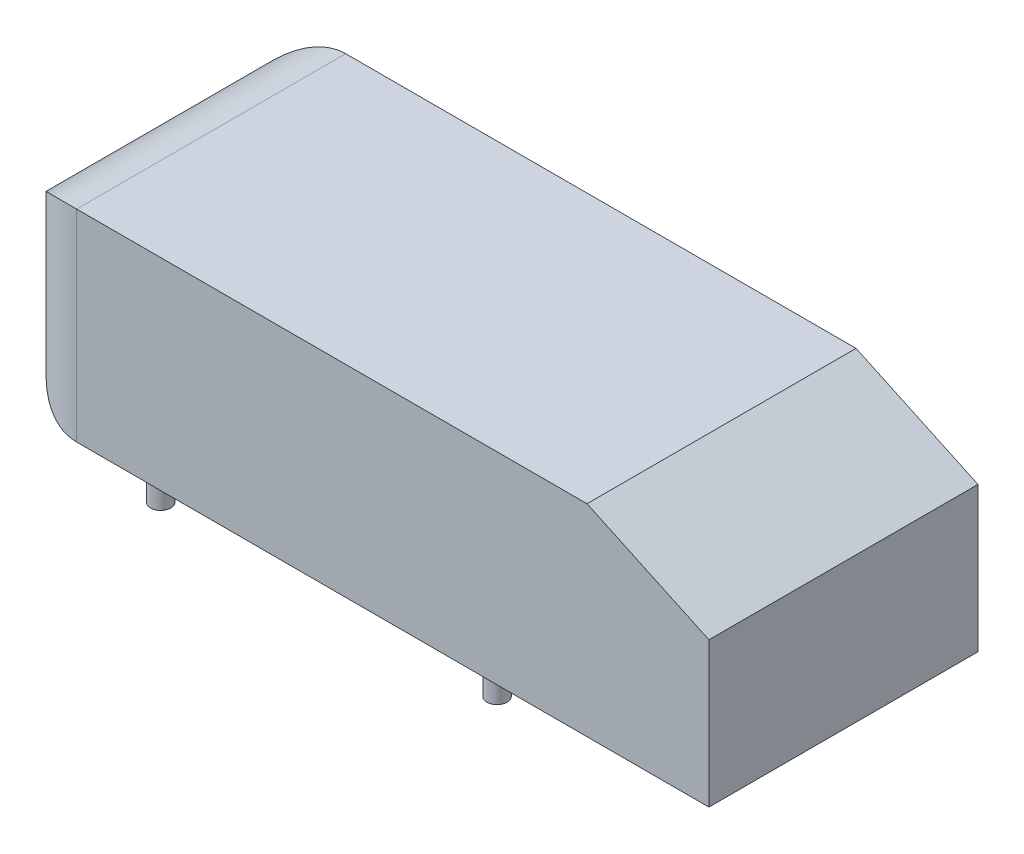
ISO-10303-21;
HEADER;
FILE_DESCRIPTION(('STEP AP214'),'2;1');
FILE_NAME('part.step','',(''),(''),'','','');
FILE_SCHEMA(('AUTOMOTIVE_DESIGN { 1 0 10303 214 1 1 1 1 }'));
ENDSEC;
DATA;
#1=APPLICATION_CONTEXT('core data for automotive mechanical design processes');
#2=APPLICATION_PROTOCOL_DEFINITION('international standard','automotive_design',2000,#1);
#3=PRODUCT_CONTEXT('',#1,'mechanical');
#4=PRODUCT('Part','Part','',(#3));
#5=PRODUCT_RELATED_PRODUCT_CATEGORY('part','',(#4));
#6=PRODUCT_DEFINITION_FORMATION('','',#4);
#7=PRODUCT_DEFINITION_CONTEXT('part definition',#1,'design');
#8=PRODUCT_DEFINITION('design','',#6,#7);
#9=PRODUCT_DEFINITION_SHAPE('','',#8);
#10=(LENGTH_UNIT() NAMED_UNIT(*) SI_UNIT(.MILLI.,.METRE.));
#11=(NAMED_UNIT(*) PLANE_ANGLE_UNIT() SI_UNIT($,.RADIAN.));
#12=(NAMED_UNIT(*) SI_UNIT($,.STERADIAN.) SOLID_ANGLE_UNIT());
#13=UNCERTAINTY_MEASURE_WITH_UNIT(LENGTH_MEASURE(1.E-05),#10,'distance_accuracy_value','');
#14=(GEOMETRIC_REPRESENTATION_CONTEXT(3) GLOBAL_UNCERTAINTY_ASSIGNED_CONTEXT((#13)) GLOBAL_UNIT_ASSIGNED_CONTEXT((#10,
#11,#12)) REPRESENTATION_CONTEXT('',''));
#15=CARTESIAN_POINT('',(0.,0.,0.));
#16=DIRECTION('',(0.,0.,1.));
#17=DIRECTION('',(1.,0.,0.));
#18=AXIS2_PLACEMENT_3D('',#15,#16,#17);
#19=CARTESIAN_POINT('',(-1050.,350.,200.));
#20=DIRECTION('',(0.,0.,1.));
#21=DIRECTION('',(0.,-1.,0.));
#22=AXIS2_PLACEMENT_3D('',#19,#20,#21);
#23=PLANE('',#22);
#24=DIRECTION('',(0.906307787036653,-0.422618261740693,0.));
#25=VECTOR('',#24,1.);
#26=CARTESIAN_POINT('',(0.,265.476347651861,200.));
#27=LINE('',#26,#25);
#28=CARTESIAN_POINT('',(-181.261557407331,350.,200.));
#29=VERTEX_POINT('',#28);
#30=CARTESIAN_POINT('',(0.,265.476347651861,200.));
#31=VERTEX_POINT('',#30);
#32=EDGE_CURVE('E64',#29,#31,#27,.T.);
#33=ORIENTED_EDGE('',*,*,#32,.F.);
#34=DIRECTION('',(1.,0.,0.));
#35=VECTOR('',#34,1.);
#36=CARTESIAN_POINT('',(-1050.,350.,200.));
#37=LINE('',#36,#35);
#38=CARTESIAN_POINT('',(-940.,350.,200.));
#39=VERTEX_POINT('',#38);
#40=EDGE_CURVE('E115',#39,#29,#37,.T.);
#41=ORIENTED_EDGE('',*,*,#40,.F.);
#42=DIRECTION('',(0.,-1.,0.));
#43=VECTOR('',#42,1.);
#44=CARTESIAN_POINT('',(-940.,50.,200.));
#45=LINE('',#44,#43);
#46=CARTESIAN_POINT('',(-940.,50.,200.));
#47=VERTEX_POINT('',#46);
#48=EDGE_CURVE('E56',#39,#47,#45,.T.);
#49=ORIENTED_EDGE('',*,*,#48,.T.);
#50=DIRECTION('',(1.,0.,0.));
#51=VECTOR('',#50,1.);
#52=CARTESIAN_POINT('',(-1050.,50.,200.));
#53=LINE('',#52,#51);
#54=CARTESIAN_POINT('',(0.,50.,200.));
#55=VERTEX_POINT('',#54);
#56=EDGE_CURVE('E135',#47,#55,#53,.T.);
#57=ORIENTED_EDGE('',*,*,#56,.T.);
#58=DIRECTION('',(0.,-1.,0.));
#59=VECTOR('',#58,1.);
#60=CARTESIAN_POINT('',(0.,350.,200.));
#61=LINE('',#60,#59);
#62=EDGE_CURVE('E118',#31,#55,#61,.T.);
#63=ORIENTED_EDGE('',*,*,#62,.F.);
#64=EDGE_LOOP('',(#33,#41,#49,#57,#63));
#65=FACE_BOUND('',#64,.T.);
#66=ADVANCED_FACE('F47',(#65),#23,.T.);
#67=CARTESIAN_POINT('',(-1050.,350.,200.));
#68=DIRECTION('',(0.,1.,0.));
#69=DIRECTION('',(0.,0.,1.));
#70=AXIS2_PLACEMENT_3D('',#67,#68,#69);
#71=PLANE('',#70);
#72=DIRECTION('',(0.,0.,1.));
#73=VECTOR('',#72,1.);
#74=CARTESIAN_POINT('',(-181.261557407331,350.,-200.));
#75=LINE('',#74,#73);
#76=CARTESIAN_POINT('',(-181.261557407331,350.,-200.));
#77=VERTEX_POINT('',#76);
#78=EDGE_CURVE('E106',#77,#29,#75,.T.);
#79=ORIENTED_EDGE('',*,*,#78,.F.);
#80=DIRECTION('',(1.,0.,0.));
#81=VECTOR('',#80,1.);
#82=CARTESIAN_POINT('',(-1050.,350.,-200.));
#83=LINE('',#82,#81);
#84=CARTESIAN_POINT('',(-940.,350.,-200.));
#85=VERTEX_POINT('',#84);
#86=EDGE_CURVE('E123',#85,#77,#83,.T.);
#87=ORIENTED_EDGE('',*,*,#86,.F.);
#88=DIRECTION('',(0.,0.,1.));
#89=VECTOR('',#88,1.);
#90=CARTESIAN_POINT('',(-940.,350.,200.));
#91=LINE('',#90,#89);
#92=EDGE_CURVE('E11',#85,#39,#91,.T.);
#93=ORIENTED_EDGE('',*,*,#92,.T.);
#94=ORIENTED_EDGE('',*,*,#40,.T.);
#95=EDGE_LOOP('',(#79,#87,#93,#94));
#96=FACE_BOUND('',#95,.T.);
#97=ADVANCED_FACE('F121',(#96),#71,.T.);
#98=CARTESIAN_POINT('',(-1050.,350.,-200.));
#99=DIRECTION('',(0.,0.,-1.));
#100=DIRECTION('',(0.,1.,0.));
#101=AXIS2_PLACEMENT_3D('',#98,#99,#100);
#102=PLANE('',#101);
#103=DIRECTION('',(0.906307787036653,-0.422618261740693,0.));
#104=VECTOR('',#103,1.);
#105=CARTESIAN_POINT('',(0.,265.476347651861,-200.));
#106=LINE('',#105,#104);
#107=CARTESIAN_POINT('',(0.,265.476347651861,-200.));
#108=VERTEX_POINT('',#107);
#109=EDGE_CURVE('E109',#77,#108,#106,.T.);
#110=ORIENTED_EDGE('',*,*,#109,.T.);
#111=DIRECTION('',(0.,1.,0.));
#112=VECTOR('',#111,1.);
#113=CARTESIAN_POINT('',(0.,350.,-200.));
#114=LINE('',#113,#112);
#115=CARTESIAN_POINT('',(0.,50.,-200.));
#116=VERTEX_POINT('',#115);
#117=EDGE_CURVE('E131',#116,#108,#114,.T.);
#118=ORIENTED_EDGE('',*,*,#117,.F.);
#119=DIRECTION('',(1.,0.,0.));
#120=VECTOR('',#119,1.);
#121=CARTESIAN_POINT('',(-1050.,50.,-200.));
#122=LINE('',#121,#120);
#123=CARTESIAN_POINT('',(-940.,50.,-200.));
#124=VERTEX_POINT('',#123);
#125=EDGE_CURVE('E128',#124,#116,#122,.T.);
#126=ORIENTED_EDGE('',*,*,#125,.F.);
#127=DIRECTION('',(0.,1.,0.));
#128=VECTOR('',#127,1.);
#129=CARTESIAN_POINT('',(-940.,350.,-200.));
#130=LINE('',#129,#128);
#131=EDGE_CURVE('E122',#124,#85,#130,.T.);
#132=ORIENTED_EDGE('',*,*,#131,.T.);
#133=ORIENTED_EDGE('',*,*,#86,.T.);
#134=EDGE_LOOP('',(#110,#118,#126,#132,#133));
#135=FACE_BOUND('',#134,.T.);
#136=ADVANCED_FACE('F198',(#135),#102,.T.);
#137=CARTESIAN_POINT('',(-1050.,50.,200.));
#138=DIRECTION('',(0.,-1.,0.));
#139=DIRECTION('',(0.,0.,-1.));
#140=AXIS2_PLACEMENT_3D('',#137,#138,#139);
#141=PLANE('',#140);
#142=CARTESIAN_POINT('',(-850.,50.,-165.));
#143=DIRECTION('',(0.,-1.,0.));
#144=DIRECTION('',(0.,0.,1.));
#145=AXIS2_PLACEMENT_3D('',#142,#143,#144);
#146=CIRCLE('',#145,15.);
#147=CARTESIAN_POINT('',(-850.,50.,-150.));
#148=VERTEX_POINT('',#147);
#149=EDGE_CURVE('E183',#148,#148,#146,.T.);
#150=ORIENTED_EDGE('',*,*,#149,.F.);
#151=EDGE_LOOP('',(#150));
#152=FACE_BOUND('',#151,.T.);
#153=CARTESIAN_POINT('',(-350.,50.,-165.));
#154=DIRECTION('',(0.,-1.,0.));
#155=DIRECTION('',(0.,0.,1.));
#156=AXIS2_PLACEMENT_3D('',#153,#154,#155);
#157=CIRCLE('',#156,15.);
#158=CARTESIAN_POINT('',(-350.,50.,-150.));
#159=VERTEX_POINT('',#158);
#160=EDGE_CURVE('E177',#159,#159,#157,.T.);
#161=ORIENTED_EDGE('',*,*,#160,.F.);
#162=EDGE_LOOP('',(#161));
#163=FACE_BOUND('',#162,.T.);
#164=CARTESIAN_POINT('',(-350.,50.,165.));
#165=DIRECTION('',(0.,-1.,0.));
#166=DIRECTION('',(0.,0.,-1.));
#167=AXIS2_PLACEMENT_3D('',#164,#165,#166);
#168=CIRCLE('',#167,15.);
#169=CARTESIAN_POINT('',(-350.,50.,150.));
#170=VERTEX_POINT('',#169);
#171=EDGE_CURVE('E171',#170,#170,#168,.T.);
#172=ORIENTED_EDGE('',*,*,#171,.F.);
#173=EDGE_LOOP('',(#172));
#174=FACE_BOUND('',#173,.T.);
#175=CARTESIAN_POINT('',(-850.,50.,165.));
#176=DIRECTION('',(0.,-1.,0.));
#177=DIRECTION('',(0.,0.,-1.));
#178=AXIS2_PLACEMENT_3D('',#175,#176,#177);
#179=CIRCLE('',#178,15.);
#180=CARTESIAN_POINT('',(-850.,50.,150.));
#181=VERTEX_POINT('',#180);
#182=EDGE_CURVE('E168',#181,#181,#179,.T.);
#183=ORIENTED_EDGE('',*,*,#182,.F.);
#184=EDGE_LOOP('',(#183));
#185=FACE_BOUND('',#184,.T.);
#186=ORIENTED_EDGE('',*,*,#56,.F.);
#187=DIRECTION('',(0.,0.,-1.));
#188=VECTOR('',#187,1.);
#189=CARTESIAN_POINT('',(-940.,50.,-200.));
#190=LINE('',#189,#188);
#191=EDGE_CURVE('E145',#47,#124,#190,.T.);
#192=ORIENTED_EDGE('',*,*,#191,.T.);
#193=ORIENTED_EDGE('',*,*,#125,.T.);
#194=DIRECTION('',(0.,0.,-1.));
#195=VECTOR('',#194,1.);
#196=CARTESIAN_POINT('',(0.,50.,200.));
#197=LINE('',#196,#195);
#198=EDGE_CURVE('E161',#55,#116,#197,.T.);
#199=ORIENTED_EDGE('',*,*,#198,.F.);
#200=EDGE_LOOP('',(#186,#192,#193,#199));
#201=FACE_BOUND('',#200,.T.);
#202=ADVANCED_FACE('F194',(#152,#163,#174,#185,#201),#141,.T.);
#203=CARTESIAN_POINT('',(-1050.,0.,0.));
#204=DIRECTION('',(1.,0.,0.));
#205=DIRECTION('',(0.,0.,-1.));
#206=AXIS2_PLACEMENT_3D('',#203,#204,#205);
#207=PLANE('',#206);
#208=DIRECTION('',(0.,0.,1.));
#209=VECTOR('',#208,1.);
#210=CARTESIAN_POINT('',(-1050.,240.,-200.));
#211=LINE('',#210,#209);
#212=CARTESIAN_POINT('',(-1050.,240.,90.0000000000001));
#213=VERTEX_POINT('',#212);
#214=CARTESIAN_POINT('',(-1050.,240.,-89.9999999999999));
#215=VERTEX_POINT('',#214);
#216=EDGE_CURVE('E126',#213,#215,#211,.F.);
#217=ORIENTED_EDGE('',*,*,#216,.T.);
#218=DIRECTION('',(0.,1.,0.));
#219=VECTOR('',#218,1.);
#220=CARTESIAN_POINT('',(-1050.,50.,-90.));
#221=LINE('',#220,#219);
#222=CARTESIAN_POINT('',(-1050.,160.,-89.9999999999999));
#223=VERTEX_POINT('',#222);
#224=EDGE_CURVE('E142',#215,#223,#221,.F.);
#225=ORIENTED_EDGE('',*,*,#224,.T.);
#226=DIRECTION('',(0.,0.,-1.));
#227=VECTOR('',#226,1.);
#228=CARTESIAN_POINT('',(-1050.,160.,200.));
#229=LINE('',#228,#227);
#230=CARTESIAN_POINT('',(-1050.,160.,90.0000000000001));
#231=VERTEX_POINT('',#230);
#232=EDGE_CURVE('E140',#223,#231,#229,.F.);
#233=ORIENTED_EDGE('',*,*,#232,.T.);
#234=DIRECTION('',(0.,-1.,0.));
#235=VECTOR('',#234,1.);
#236=CARTESIAN_POINT('',(-1050.,350.,90.0000000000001));
#237=LINE('',#236,#235);
#238=EDGE_CURVE('E138',#231,#213,#237,.F.);
#239=ORIENTED_EDGE('',*,*,#238,.T.);
#240=EDGE_LOOP('',(#217,#225,#233,#239));
#241=FACE_BOUND('',#240,.T.);
#242=ADVANCED_FACE('F197',(#241),#207,.F.);
#243=CARTESIAN_POINT('',(0.,0.,0.));
#244=DIRECTION('',(1.,0.,0.));
#245=DIRECTION('',(0.,0.,-1.));
#246=AXIS2_PLACEMENT_3D('',#243,#244,#245);
#247=PLANE('',#246);
#248=DIRECTION('',(0.,0.,1.));
#249=VECTOR('',#248,1.);
#250=CARTESIAN_POINT('',(0.,265.476347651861,-200.));
#251=LINE('',#250,#249);
#252=EDGE_CURVE('E111',#108,#31,#251,.T.);
#253=ORIENTED_EDGE('',*,*,#252,.T.);
#254=ORIENTED_EDGE('',*,*,#62,.T.);
#255=ORIENTED_EDGE('',*,*,#198,.T.);
#256=ORIENTED_EDGE('',*,*,#117,.T.);
#257=EDGE_LOOP('',(#253,#254,#255,#256));
#258=FACE_BOUND('',#257,.T.);
#259=ADVANCED_FACE('F221',(#258),#247,.T.);
#260=CARTESIAN_POINT('',(-940.,350.,90.0000000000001));
#261=DIRECTION('',(0.,1.,0.));
#262=DIRECTION('',(0.,0.,1.));
#263=AXIS2_PLACEMENT_3D('',#260,#261,#262);
#264=CYLINDRICAL_SURFACE('',#263,110.);
#265=CARTESIAN_POINT('',(-940.,240.,90.0000000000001));
#266=DIRECTION('',(0.,0.707106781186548,-0.707106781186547));
#267=DIRECTION('',(0.,-0.707106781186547,-0.707106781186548));
#268=AXIS2_PLACEMENT_3D('',#265,#266,#267);
#269=ELLIPSE('',#268,155.56349186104,110.);
#270=EDGE_CURVE('E151',#213,#39,#269,.T.);
#271=ORIENTED_EDGE('',*,*,#270,.F.);
#272=ORIENTED_EDGE('',*,*,#238,.F.);
#273=CARTESIAN_POINT('',(-940.,160.,90.0000000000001));
#274=DIRECTION('',(0.,0.707106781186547,0.707106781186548));
#275=DIRECTION('',(0.,0.707106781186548,-0.707106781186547));
#276=AXIS2_PLACEMENT_3D('',#273,#274,#275);
#277=ELLIPSE('',#276,155.56349186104,110.);
#278=EDGE_CURVE('E51',#47,#231,#277,.F.);
#279=ORIENTED_EDGE('',*,*,#278,.F.);
#280=ORIENTED_EDGE('',*,*,#48,.F.);
#281=EDGE_LOOP('',(#271,#272,#279,#280));
#282=FACE_BOUND('',#281,.T.);
#283=ADVANCED_FACE('F49',(#282),#264,.T.);
#284=CARTESIAN_POINT('',(-940.,160.,200.));
#285=DIRECTION('',(0.,0.,1.));
#286=DIRECTION('',(1.,0.,0.));
#287=AXIS2_PLACEMENT_3D('',#284,#285,#286);
#288=CYLINDRICAL_SURFACE('',#287,110.);
#289=ORIENTED_EDGE('',*,*,#278,.T.);
#290=ORIENTED_EDGE('',*,*,#232,.F.);
#291=CARTESIAN_POINT('',(-940.,160.,-89.9999999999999));
#292=DIRECTION('',(0.,-0.707106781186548,0.707106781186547));
#293=DIRECTION('',(0.,0.707106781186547,0.707106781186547));
#294=AXIS2_PLACEMENT_3D('',#291,#292,#293);
#295=ELLIPSE('',#294,155.56349186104,110.);
#296=EDGE_CURVE('E150',#124,#223,#295,.F.);
#297=ORIENTED_EDGE('',*,*,#296,.F.);
#298=ORIENTED_EDGE('',*,*,#191,.F.);
#299=EDGE_LOOP('',(#289,#290,#297,#298));
#300=FACE_BOUND('',#299,.T.);
#301=ADVANCED_FACE('F212',(#300),#288,.T.);
#302=CARTESIAN_POINT('',(-940.,240.,200.));
#303=DIRECTION('',(0.,0.,-1.));
#304=DIRECTION('',(0.,1.,0.));
#305=AXIS2_PLACEMENT_3D('',#302,#303,#304);
#306=CYLINDRICAL_SURFACE('',#305,110.);
#307=ORIENTED_EDGE('',*,*,#270,.T.);
#308=ORIENTED_EDGE('',*,*,#92,.F.);
#309=CARTESIAN_POINT('',(-940.,240.,-89.9999999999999));
#310=DIRECTION('',(0.,-0.707106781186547,-0.707106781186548));
#311=DIRECTION('',(0.,0.707106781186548,-0.707106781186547));
#312=AXIS2_PLACEMENT_3D('',#309,#310,#311);
#313=ELLIPSE('',#312,155.56349186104,110.);
#314=EDGE_CURVE('E148',#215,#85,#313,.T.);
#315=ORIENTED_EDGE('',*,*,#314,.F.);
#316=ORIENTED_EDGE('',*,*,#216,.F.);
#317=EDGE_LOOP('',(#307,#308,#315,#316));
#318=FACE_BOUND('',#317,.T.);
#319=ADVANCED_FACE('F242',(#318),#306,.T.);
#320=CARTESIAN_POINT('',(-940.,350.,-89.9999999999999));
#321=DIRECTION('',(0.,-1.,0.));
#322=DIRECTION('',(0.,0.,-1.));
#323=AXIS2_PLACEMENT_3D('',#320,#321,#322);
#324=CYLINDRICAL_SURFACE('',#323,110.);
#325=ORIENTED_EDGE('',*,*,#296,.T.);
#326=ORIENTED_EDGE('',*,*,#224,.F.);
#327=ORIENTED_EDGE('',*,*,#314,.T.);
#328=ORIENTED_EDGE('',*,*,#131,.F.);
#329=EDGE_LOOP('',(#325,#326,#327,#328));
#330=FACE_BOUND('',#329,.T.);
#331=ADVANCED_FACE('F216',(#330),#324,.T.);
#332=CARTESIAN_POINT('',(0.,265.476347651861,-200.));
#333=DIRECTION('',(-0.422618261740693,-0.906307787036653,0.));
#334=DIRECTION('',(0.906307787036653,-0.422618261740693,0.));
#335=AXIS2_PLACEMENT_3D('',#332,#333,#334);
#336=PLANE('',#335);
#337=ORIENTED_EDGE('',*,*,#252,.F.);
#338=ORIENTED_EDGE('',*,*,#109,.F.);
#339=ORIENTED_EDGE('',*,*,#78,.T.);
#340=ORIENTED_EDGE('',*,*,#32,.T.);
#341=EDGE_LOOP('',(#337,#338,#339,#340));
#342=FACE_BOUND('',#341,.T.);
#343=ADVANCED_FACE('F107',(#342),#336,.F.);
#344=CARTESIAN_POINT('',(-850.,0.,165.));
#345=DIRECTION('',(0.,1.,0.));
#346=DIRECTION('',(0.,0.,1.));
#347=AXIS2_PLACEMENT_3D('',#344,#345,#346);
#348=CYLINDRICAL_SURFACE('',#347,15.);
#349=CARTESIAN_POINT('',(-850.,0.,165.));
#350=DIRECTION('',(0.,-1.,0.));
#351=DIRECTION('',(0.,0.,-1.));
#352=AXIS2_PLACEMENT_3D('',#349,#350,#351);
#353=CIRCLE('',#352,15.);
#354=CARTESIAN_POINT('',(-850.,0.,150.));
#355=VERTEX_POINT('',#354);
#356=EDGE_CURVE('E119',#355,#355,#353,.T.);
#357=ORIENTED_EDGE('',*,*,#356,.F.);
#358=EDGE_LOOP('',(#357));
#359=FACE_BOUND('',#358,.T.);
#360=ORIENTED_EDGE('',*,*,#182,.T.);
#361=EDGE_LOOP('',(#360));
#362=FACE_BOUND('',#361,.T.);
#363=ADVANCED_FACE('F306',(#359,#362),#348,.T.);
#364=CARTESIAN_POINT('',(-850.,0.,165.));
#365=DIRECTION('',(0.,-1.,0.));
#366=DIRECTION('',(0.,0.,-1.));
#367=AXIS2_PLACEMENT_3D('',#364,#365,#366);
#368=PLANE('',#367);
#369=ORIENTED_EDGE('',*,*,#356,.T.);
#370=EDGE_LOOP('',(#369));
#371=FACE_BOUND('',#370,.T.);
#372=ADVANCED_FACE('F313',(#371),#368,.T.);
#373=CARTESIAN_POINT('',(-350.,0.,165.));
#374=DIRECTION('',(0.,1.,0.));
#375=DIRECTION('',(0.,0.,1.));
#376=AXIS2_PLACEMENT_3D('',#373,#374,#375);
#377=CYLINDRICAL_SURFACE('',#376,15.);
#378=CARTESIAN_POINT('',(-350.,0.,165.));
#379=DIRECTION('',(0.,-1.,0.));
#380=DIRECTION('',(0.,0.,-1.));
#381=AXIS2_PLACEMENT_3D('',#378,#379,#380);
#382=CIRCLE('',#381,15.);
#383=CARTESIAN_POINT('',(-350.,0.,150.));
#384=VERTEX_POINT('',#383);
#385=EDGE_CURVE('E174',#384,#384,#382,.T.);
#386=ORIENTED_EDGE('',*,*,#385,.F.);
#387=EDGE_LOOP('',(#386));
#388=FACE_BOUND('',#387,.T.);
#389=ORIENTED_EDGE('',*,*,#171,.T.);
#390=EDGE_LOOP('',(#389));
#391=FACE_BOUND('',#390,.T.);
#392=ADVANCED_FACE('F322',(#388,#391),#377,.T.);
#393=CARTESIAN_POINT('',(-350.,0.,165.));
#394=DIRECTION('',(0.,-1.,0.));
#395=DIRECTION('',(0.,0.,-1.));
#396=AXIS2_PLACEMENT_3D('',#393,#394,#395);
#397=PLANE('',#396);
#398=ORIENTED_EDGE('',*,*,#385,.T.);
#399=EDGE_LOOP('',(#398));
#400=FACE_BOUND('',#399,.T.);
#401=ADVANCED_FACE('F331',(#400),#397,.T.);
#402=CARTESIAN_POINT('',(-350.,0.,-165.));
#403=DIRECTION('',(0.,1.,0.));
#404=DIRECTION('',(0.,0.,1.));
#405=AXIS2_PLACEMENT_3D('',#402,#403,#404);
#406=CYLINDRICAL_SURFACE('',#405,15.);
#407=CARTESIAN_POINT('',(-350.,0.,-165.));
#408=DIRECTION('',(0.,-1.,0.));
#409=DIRECTION('',(0.,0.,1.));
#410=AXIS2_PLACEMENT_3D('',#407,#408,#409);
#411=CIRCLE('',#410,15.);
#412=CARTESIAN_POINT('',(-350.,0.,-150.));
#413=VERTEX_POINT('',#412);
#414=EDGE_CURVE('E180',#413,#413,#411,.T.);
#415=ORIENTED_EDGE('',*,*,#414,.F.);
#416=EDGE_LOOP('',(#415));
#417=FACE_BOUND('',#416,.T.);
#418=ORIENTED_EDGE('',*,*,#160,.T.);
#419=EDGE_LOOP('',(#418));
#420=FACE_BOUND('',#419,.T.);
#421=ADVANCED_FACE('F340',(#417,#420),#406,.T.);
#422=CARTESIAN_POINT('',(-350.,0.,-165.));
#423=DIRECTION('',(0.,1.,0.));
#424=DIRECTION('',(0.,0.,1.));
#425=AXIS2_PLACEMENT_3D('',#422,#423,#424);
#426=PLANE('',#425);
#427=ORIENTED_EDGE('',*,*,#414,.T.);
#428=EDGE_LOOP('',(#427));
#429=FACE_BOUND('',#428,.T.);
#430=ADVANCED_FACE('F349',(#429),#426,.F.);
#431=CARTESIAN_POINT('',(-850.,0.,-165.));
#432=DIRECTION('',(0.,1.,0.));
#433=DIRECTION('',(0.,0.,1.));
#434=AXIS2_PLACEMENT_3D('',#431,#432,#433);
#435=CYLINDRICAL_SURFACE('',#434,15.);
#436=CARTESIAN_POINT('',(-850.,0.,-165.));
#437=DIRECTION('',(0.,-1.,0.));
#438=DIRECTION('',(0.,0.,1.));
#439=AXIS2_PLACEMENT_3D('',#436,#437,#438);
#440=CIRCLE('',#439,15.);
#441=CARTESIAN_POINT('',(-850.,0.,-150.));
#442=VERTEX_POINT('',#441);
#443=EDGE_CURVE('E186',#442,#442,#440,.T.);
#444=ORIENTED_EDGE('',*,*,#443,.F.);
#445=EDGE_LOOP('',(#444));
#446=FACE_BOUND('',#445,.T.);
#447=ORIENTED_EDGE('',*,*,#149,.T.);
#448=EDGE_LOOP('',(#447));
#449=FACE_BOUND('',#448,.T.);
#450=ADVANCED_FACE('F192',(#446,#449),#435,.T.);
#451=CARTESIAN_POINT('',(-850.,0.,-165.));
#452=DIRECTION('',(0.,1.,0.));
#453=DIRECTION('',(0.,0.,1.));
#454=AXIS2_PLACEMENT_3D('',#451,#452,#453);
#455=PLANE('',#454);
#456=ORIENTED_EDGE('',*,*,#443,.T.);
#457=EDGE_LOOP('',(#456));
#458=FACE_BOUND('',#457,.T.);
#459=ADVANCED_FACE('F366',(#458),#455,.F.);
#460=CLOSED_SHELL('',(#66,#97,#136,#202,#242,#259,#283,#301,#319,#331,#343,#363,#372,#392,#401,
#421,#430,#450,#459));
#461=MANIFOLD_SOLID_BREP('B2',#460);
#462=ADVANCED_BREP_SHAPE_REPRESENTATION('',(#18,#461),#14);
#463=SHAPE_DEFINITION_REPRESENTATION(#9,#462);
ENDSEC;
END-ISO-10303-21;
